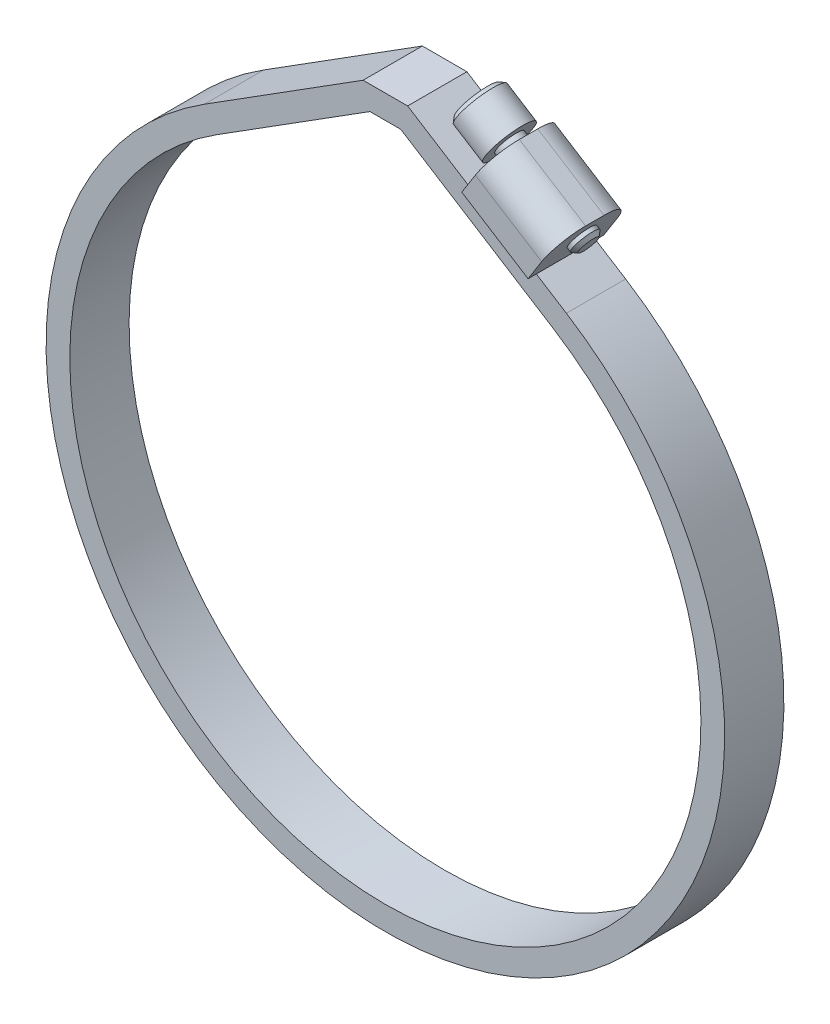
ISO-10303-21;
HEADER;
FILE_DESCRIPTION(('STEP AP214'),'2;1');
FILE_NAME('part.step','',(''),(''),'','','');
FILE_SCHEMA(('AUTOMOTIVE_DESIGN { 1 0 10303 214 1 1 1 1 }'));
ENDSEC;
DATA;
#1=APPLICATION_CONTEXT('core data for automotive mechanical design processes');
#2=APPLICATION_PROTOCOL_DEFINITION('international standard','automotive_design',2000,#1);
#3=PRODUCT_CONTEXT('',#1,'mechanical');
#4=PRODUCT('Part','Part','',(#3));
#5=PRODUCT_RELATED_PRODUCT_CATEGORY('part','',(#4));
#6=PRODUCT_DEFINITION_FORMATION('','',#4);
#7=PRODUCT_DEFINITION_CONTEXT('part definition',#1,'design');
#8=PRODUCT_DEFINITION('design','',#6,#7);
#9=PRODUCT_DEFINITION_SHAPE('','',#8);
#10=(LENGTH_UNIT() NAMED_UNIT(*) SI_UNIT(.MILLI.,.METRE.));
#11=(NAMED_UNIT(*) PLANE_ANGLE_UNIT() SI_UNIT($,.RADIAN.));
#12=(NAMED_UNIT(*) SI_UNIT($,.STERADIAN.) SOLID_ANGLE_UNIT());
#13=UNCERTAINTY_MEASURE_WITH_UNIT(LENGTH_MEASURE(1.E-05),#10,'distance_accuracy_value','');
#14=(GEOMETRIC_REPRESENTATION_CONTEXT(3) GLOBAL_UNCERTAINTY_ASSIGNED_CONTEXT((#13)) GLOBAL_UNIT_ASSIGNED_CONTEXT((#10,
#11,#12)) REPRESENTATION_CONTEXT('',''));
#15=CARTESIAN_POINT('',(0.,0.,0.));
#16=DIRECTION('',(0.,0.,1.));
#17=DIRECTION('',(1.,0.,0.));
#18=AXIS2_PLACEMENT_3D('',#15,#16,#17);
#19=CARTESIAN_POINT('',(23.8835334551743,46.7084663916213,5.0292));
#20=DIRECTION('',(-0.845790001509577,0.533515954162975,0.));
#21=DIRECTION('',(-0.533515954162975,-0.845790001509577,0.));
#22=AXIS2_PLACEMENT_3D('',#19,#20,#21);
#23=PLANE('',#22);
#24=DIRECTION('',(0.533515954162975,0.845790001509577,0.));
#25=VECTOR('',#24,1.);
#26=CARTESIAN_POINT('',(23.8835334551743,46.7084663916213,-5.0292));
#27=LINE('',#26,#25);
#28=CARTESIAN_POINT('',(20.04851407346,40.6287587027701,-5.0292));
#29=VERTEX_POINT('',#28);
#30=CARTESIAN_POINT('',(21.8508376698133,43.4860064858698,-5.0292));
#31=VERTEX_POINT('',#30);
#32=EDGE_CURVE('E288',#29,#31,#27,.T.);
#33=ORIENTED_EDGE('',*,*,#32,.T.);
#34=CARTESIAN_POINT('',(21.8508376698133,43.4860064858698,-1.2192));
#35=DIRECTION('',(-0.845790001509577,0.533515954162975,0.));
#36=DIRECTION('',(-0.533515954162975,-0.845790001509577,0.));
#37=AXIS2_PLACEMENT_3D('',#34,#35,#36);
#38=CIRCLE('',#37,3.81);
#39=CARTESIAN_POINT('',(23.8835334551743,46.7084663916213,-1.2192));
#40=VERTEX_POINT('',#39);
#41=EDGE_CURVE('E319',#31,#40,#38,.F.);
#42=ORIENTED_EDGE('',*,*,#41,.T.);
#43=DIRECTION('',(0.,0.,-1.));
#44=VECTOR('',#43,1.);
#45=CARTESIAN_POINT('',(23.8835334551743,46.7084663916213,5.0292));
#46=LINE('',#45,#44);
#47=CARTESIAN_POINT('',(23.8835334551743,46.7084663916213,1.2192));
#48=VERTEX_POINT('',#47);
#49=EDGE_CURVE('E298',#48,#40,#46,.T.);
#50=ORIENTED_EDGE('',*,*,#49,.F.);
#51=CARTESIAN_POINT('',(21.8508376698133,43.4860064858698,1.2192));
#52=DIRECTION('',(-0.845790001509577,0.533515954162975,0.));
#53=DIRECTION('',(-0.533515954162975,-0.845790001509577,0.));
#54=AXIS2_PLACEMENT_3D('',#51,#52,#53);
#55=CIRCLE('',#54,3.81);
#56=CARTESIAN_POINT('',(21.8508376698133,43.4860064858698,5.0292));
#57=VERTEX_POINT('',#56);
#58=EDGE_CURVE('E317',#48,#57,#55,.F.);
#59=ORIENTED_EDGE('',*,*,#58,.T.);
#60=DIRECTION('',(0.533515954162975,0.845790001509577,0.));
#61=VECTOR('',#60,1.);
#62=CARTESIAN_POINT('',(23.8835334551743,46.7084663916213,5.0292));
#63=LINE('',#62,#61);
#64=CARTESIAN_POINT('',(20.04851407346,40.6287587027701,5.0292));
#65=VERTEX_POINT('',#64);
#66=EDGE_CURVE('E279',#65,#57,#63,.T.);
#67=ORIENTED_EDGE('',*,*,#66,.F.);
#68=DIRECTION('',(0.,0.,-1.));
#69=VECTOR('',#68,1.);
#70=CARTESIAN_POINT('',(20.04851407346,40.6287587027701,5.0292));
#71=LINE('',#70,#69);
#72=CARTESIAN_POINT('',(20.04851407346,40.6287587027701,3.937));
#73=VERTEX_POINT('',#72);
#74=EDGE_CURVE('E302',#65,#73,#71,.T.);
#75=ORIENTED_EDGE('',*,*,#74,.T.);
#76=CARTESIAN_POINT('',(20.04851407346,40.6287587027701,-3.937));
#77=VERTEX_POINT('',#76);
#78=EDGE_CURVE('E306',#73,#77,#71,.T.);
#79=ORIENTED_EDGE('',*,*,#78,.T.);
#80=EDGE_CURVE('E301',#77,#29,#71,.T.);
#81=ORIENTED_EDGE('',*,*,#80,.T.);
#82=EDGE_LOOP('',(#33,#42,#50,#59,#67,#75,#79,#81));
#83=FACE_BOUND('',#82,.T.);
#84=CARTESIAN_POINT('',(22.1896203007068,44.0230831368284,0.));
#85=DIRECTION('',(-0.845790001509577,0.533515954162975,0.));
#86=DIRECTION('',(-0.533515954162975,-0.845790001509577,0.));
#87=AXIS2_PLACEMENT_3D('',#84,#85,#86);
#88=CIRCLE('',#87,1.74624999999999);
#89=CARTESIAN_POINT('',(21.2579680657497,42.5461223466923,0.));
#90=VERTEX_POINT('',#89);
#91=EDGE_CURVE('E11',#90,#90,#88,.F.);
#92=ORIENTED_EDGE('',*,*,#91,.F.);
#93=EDGE_LOOP('',(#92));
#94=FACE_BOUND('',#93,.T.);
#95=ADVANCED_FACE('F39',(#83,#94),#23,.F.);
#96=CARTESIAN_POINT('',(11.2456163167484,46.1815394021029,5.0292));
#97=DIRECTION('',(0.845790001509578,-0.533515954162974,0.));
#98=DIRECTION('',(0.533515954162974,0.845790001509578,0.));
#99=AXIS2_PLACEMENT_3D('',#96,#97,#98);
#100=PLANE('',#99);
#101=DIRECTION('',(0.,0.,-1.));
#102=VECTOR('',#101,1.);
#103=CARTESIAN_POINT('',(15.0806356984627,52.2612470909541,5.0292));
#104=LINE('',#103,#102);
#105=CARTESIAN_POINT('',(15.0806356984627,52.2612470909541,1.2192));
#106=VERTEX_POINT('',#105);
#107=CARTESIAN_POINT('',(15.0806356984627,52.2612470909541,-1.2192));
#108=VERTEX_POINT('',#107);
#109=EDGE_CURVE('E294',#106,#108,#104,.T.);
#110=ORIENTED_EDGE('',*,*,#109,.T.);
#111=CARTESIAN_POINT('',(13.0479399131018,49.0387871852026,-1.2192));
#112=DIRECTION('',(0.845790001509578,-0.533515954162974,0.));
#113=DIRECTION('',(0.533515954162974,0.845790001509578,0.));
#114=AXIS2_PLACEMENT_3D('',#111,#112,#113);
#115=CIRCLE('',#114,3.81);
#116=CARTESIAN_POINT('',(13.0479399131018,49.0387871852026,-5.0292));
#117=VERTEX_POINT('',#116);
#118=EDGE_CURVE('E313',#108,#117,#115,.F.);
#119=ORIENTED_EDGE('',*,*,#118,.T.);
#120=DIRECTION('',(-0.533515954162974,-0.845790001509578,0.));
#121=VECTOR('',#120,1.);
#122=CARTESIAN_POINT('',(11.2456163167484,46.1815394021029,-5.0292));
#123=LINE('',#122,#121);
#124=CARTESIAN_POINT('',(11.2456163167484,46.1815394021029,-5.0292));
#125=VERTEX_POINT('',#124);
#126=EDGE_CURVE('E280',#117,#125,#123,.T.);
#127=ORIENTED_EDGE('',*,*,#126,.T.);
#128=DIRECTION('',(0.,0.,-1.));
#129=VECTOR('',#128,1.);
#130=CARTESIAN_POINT('',(11.2456163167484,46.1815394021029,5.0292));
#131=LINE('',#130,#129);
#132=CARTESIAN_POINT('',(11.2456163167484,46.1815394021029,-3.937));
#133=VERTEX_POINT('',#132);
#134=EDGE_CURVE('E285',#133,#125,#131,.T.);
#135=ORIENTED_EDGE('',*,*,#134,.F.);
#136=CARTESIAN_POINT('',(11.2456163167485,46.1815394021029,3.937));
#137=VERTEX_POINT('',#136);
#138=EDGE_CURVE('E295',#137,#133,#131,.T.);
#139=ORIENTED_EDGE('',*,*,#138,.F.);
#140=CARTESIAN_POINT('',(11.2456163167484,46.1815394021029,5.0292));
#141=VERTEX_POINT('',#140);
#142=EDGE_CURVE('E55',#141,#137,#131,.T.);
#143=ORIENTED_EDGE('',*,*,#142,.F.);
#144=DIRECTION('',(-0.533515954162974,-0.845790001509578,0.));
#145=VECTOR('',#144,1.);
#146=CARTESIAN_POINT('',(11.2456163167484,46.1815394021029,5.0292));
#147=LINE('',#146,#145);
#148=CARTESIAN_POINT('',(13.0479399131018,49.0387871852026,5.0292));
#149=VERTEX_POINT('',#148);
#150=EDGE_CURVE('E283',#149,#141,#147,.T.);
#151=ORIENTED_EDGE('',*,*,#150,.F.);
#152=CARTESIAN_POINT('',(13.0479399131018,49.0387871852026,1.2192));
#153=DIRECTION('',(0.845790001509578,-0.533515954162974,0.));
#154=DIRECTION('',(0.533515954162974,0.845790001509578,0.));
#155=AXIS2_PLACEMENT_3D('',#152,#153,#154);
#156=CIRCLE('',#155,3.81);
#157=EDGE_CURVE('E311',#149,#106,#156,.F.);
#158=ORIENTED_EDGE('',*,*,#157,.T.);
#159=EDGE_LOOP('',(#110,#119,#127,#135,#139,#143,#151,#158));
#160=FACE_BOUND('',#159,.T.);
#161=CARTESIAN_POINT('',(13.3867225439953,49.5758638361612,0.));
#162=DIRECTION('',(0.845790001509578,-0.533515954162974,0.));
#163=DIRECTION('',(0.533515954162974,0.845790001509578,0.));
#164=AXIS2_PLACEMENT_3D('',#161,#162,#163);
#165=CIRCLE('',#164,1.74624999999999);
#166=CARTESIAN_POINT('',(14.3183747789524,51.0528246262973,0.));
#167=VERTEX_POINT('',#166);
#168=EDGE_CURVE('E43',#167,#167,#165,.F.);
#169=ORIENTED_EDGE('',*,*,#168,.F.);
#170=EDGE_LOOP('',(#169));
#171=FACE_BOUND('',#170,.T.);
#172=ADVANCED_FACE('F411',(#160,#171),#100,.F.);
#173=CARTESIAN_POINT('',(2.95750169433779,51.4096,-3.937));
#174=DIRECTION('',(0.533515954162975,0.845790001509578,0.));
#175=DIRECTION('',(-0.845790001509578,0.533515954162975,0.));
#176=AXIS2_PLACEMENT_3D('',#173,#174,#175);
#177=PLANE('',#176);
#178=DIRECTION('',(-0.845790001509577,0.533515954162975,0.));
#179=VECTOR('',#178,1.);
#180=CARTESIAN_POINT('',(2.95750169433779,51.4096,-3.937));
#181=LINE('',#180,#179);
#182=CARTESIAN_POINT('',(24.040015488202,38.1109591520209,-3.937));
#183=VERTEX_POINT('',#182);
#184=EDGE_CURVE('E363',#183,#77,#181,.T.);
#185=ORIENTED_EDGE('',*,*,#184,.T.);
#186=ORIENTED_EDGE('',*,*,#78,.F.);
#187=DIRECTION('',(-0.845790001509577,0.533515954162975,0.));
#188=VECTOR('',#187,1.);
#189=CARTESIAN_POINT('',(2.95750169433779,51.4096,3.937));
#190=LINE('',#189,#188);
#191=CARTESIAN_POINT('',(24.040015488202,38.1109591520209,3.937));
#192=VERTEX_POINT('',#191);
#193=EDGE_CURVE('E373',#192,#73,#190,.T.);
#194=ORIENTED_EDGE('',*,*,#193,.F.);
#195=DIRECTION('',(0.,0.,1.));
#196=VECTOR('',#195,1.);
#197=CARTESIAN_POINT('',(24.040015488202,38.1109591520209,-3.937));
#198=LINE('',#197,#196);
#199=EDGE_CURVE('E90',#183,#192,#198,.T.);
#200=ORIENTED_EDGE('',*,*,#199,.F.);
#201=EDGE_LOOP('',(#185,#186,#194,#200));
#202=FACE_BOUND('',#201,.T.);
#203=ADVANCED_FACE('F388',(#202),#177,.T.);
#204=CARTESIAN_POINT('',(2.95750169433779,51.4096,3.937));
#205=VERTEX_POINT('',#204);
#206=EDGE_CURVE('E372',#137,#205,#190,.T.);
#207=ORIENTED_EDGE('',*,*,#206,.F.);
#208=ORIENTED_EDGE('',*,*,#138,.T.);
#209=CARTESIAN_POINT('',(2.95750169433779,51.4096,-3.937));
#210=VERTEX_POINT('',#209);
#211=EDGE_CURVE('E361',#133,#210,#181,.T.);
#212=ORIENTED_EDGE('',*,*,#211,.T.);
#213=DIRECTION('',(0.,0.,1.));
#214=VECTOR('',#213,1.);
#215=CARTESIAN_POINT('',(2.95750169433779,51.4096,-3.937));
#216=LINE('',#215,#214);
#217=EDGE_CURVE('E385',#210,#205,#216,.T.);
#218=ORIENTED_EDGE('',*,*,#217,.T.);
#219=EDGE_LOOP('',(#207,#208,#212,#218));
#220=FACE_BOUND('',#219,.T.);
#221=ADVANCED_FACE('F417',(#220),#177,.T.);
#222=CARTESIAN_POINT('',(0.,0.,-3.937));
#223=DIRECTION('',(0.,0.,1.));
#224=DIRECTION('',(1.,0.,0.));
#225=AXIS2_PLACEMENT_3D('',#222,#223,#224);
#226=CYLINDRICAL_SURFACE('',#225,45.0596);
#227=CARTESIAN_POINT('',(0.,0.,3.937));
#228=DIRECTION('',(0.,0.,1.));
#229=DIRECTION('',(1.,0.,0.));
#230=AXIS2_PLACEMENT_3D('',#227,#228,#229);
#231=CIRCLE('',#230,45.0596);
#232=CARTESIAN_POINT('',(-24.040015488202,38.1109591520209,3.937));
#233=VERTEX_POINT('',#232);
#234=EDGE_CURVE('E330',#233,#192,#231,.T.);
#235=ORIENTED_EDGE('',*,*,#234,.F.);
#236=DIRECTION('',(0.,0.,1.));
#237=VECTOR('',#236,1.);
#238=CARTESIAN_POINT('',(-24.040015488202,38.1109591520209,-3.937));
#239=LINE('',#238,#237);
#240=CARTESIAN_POINT('',(-24.040015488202,38.1109591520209,-3.937));
#241=VERTEX_POINT('',#240);
#242=EDGE_CURVE('E64',#241,#233,#239,.T.);
#243=ORIENTED_EDGE('',*,*,#242,.F.);
#244=CARTESIAN_POINT('',(0.,0.,-3.937));
#245=DIRECTION('',(0.,0.,1.));
#246=DIRECTION('',(1.,0.,0.));
#247=AXIS2_PLACEMENT_3D('',#244,#245,#246);
#248=CIRCLE('',#247,45.0596);
#249=EDGE_CURVE('E359',#241,#183,#248,.T.);
#250=ORIENTED_EDGE('',*,*,#249,.T.);
#251=ORIENTED_EDGE('',*,*,#199,.T.);
#252=EDGE_LOOP('',(#235,#243,#250,#251));
#253=FACE_BOUND('',#252,.T.);
#254=ADVANCED_FACE('F41',(#253),#226,.T.);
#255=CARTESIAN_POINT('',(-24.040015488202,38.1109591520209,-3.937));
#256=DIRECTION('',(-0.533515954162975,0.845790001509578,0.));
#257=DIRECTION('',(-0.845790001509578,-0.533515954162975,0.));
#258=AXIS2_PLACEMENT_3D('',#255,#256,#257);
#259=PLANE('',#258);
#260=DIRECTION('',(-0.845790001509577,-0.533515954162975,0.));
#261=VECTOR('',#260,1.);
#262=CARTESIAN_POINT('',(-24.040015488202,38.1109591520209,3.937));
#263=LINE('',#262,#261);
#264=CARTESIAN_POINT('',(-2.95750169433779,51.4096,3.937));
#265=VERTEX_POINT('',#264);
#266=EDGE_CURVE('E362',#265,#233,#263,.T.);
#267=ORIENTED_EDGE('',*,*,#266,.F.);
#268=DIRECTION('',(0.,0.,1.));
#269=VECTOR('',#268,1.);
#270=CARTESIAN_POINT('',(-2.95750169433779,51.4096,-3.937));
#271=LINE('',#270,#269);
#272=CARTESIAN_POINT('',(-2.95750169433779,51.4096,-3.937));
#273=VERTEX_POINT('',#272);
#274=EDGE_CURVE('E383',#273,#265,#271,.T.);
#275=ORIENTED_EDGE('',*,*,#274,.F.);
#276=DIRECTION('',(-0.845790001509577,-0.533515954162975,0.));
#277=VECTOR('',#276,1.);
#278=CARTESIAN_POINT('',(-24.040015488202,38.1109591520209,-3.937));
#279=LINE('',#278,#277);
#280=EDGE_CURVE('E368',#273,#241,#279,.T.);
#281=ORIENTED_EDGE('',*,*,#280,.T.);
#282=ORIENTED_EDGE('',*,*,#242,.T.);
#283=EDGE_LOOP('',(#267,#275,#281,#282));
#284=FACE_BOUND('',#283,.T.);
#285=ADVANCED_FACE('F395',(#284),#259,.T.);
#286=CARTESIAN_POINT('',(-2.95750169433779,51.4096,-3.937));
#287=DIRECTION('',(0.,1.,0.));
#288=DIRECTION('',(0.,0.,1.));
#289=AXIS2_PLACEMENT_3D('',#286,#287,#288);
#290=PLANE('',#289);
#291=DIRECTION('',(-1.,0.,0.));
#292=VECTOR('',#291,1.);
#293=CARTESIAN_POINT('',(-2.95750169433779,51.4096,3.937));
#294=LINE('',#293,#292);
#295=EDGE_CURVE('E376',#205,#265,#294,.T.);
#296=ORIENTED_EDGE('',*,*,#295,.F.);
#297=ORIENTED_EDGE('',*,*,#217,.F.);
#298=DIRECTION('',(-1.,0.,0.));
#299=VECTOR('',#298,1.);
#300=CARTESIAN_POINT('',(-2.95750169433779,51.4096,-3.937));
#301=LINE('',#300,#299);
#302=EDGE_CURVE('E365',#210,#273,#301,.T.);
#303=ORIENTED_EDGE('',*,*,#302,.T.);
#304=ORIENTED_EDGE('',*,*,#274,.T.);
#305=EDGE_LOOP('',(#296,#297,#303,#304));
#306=FACE_BOUND('',#305,.T.);
#307=ADVANCED_FACE('F400',(#306),#290,.T.);
#308=CARTESIAN_POINT('',(0.,0.,-3.937));
#309=DIRECTION('',(0.,0.,1.));
#310=DIRECTION('',(1.,0.,0.));
#311=AXIS2_PLACEMENT_3D('',#308,#309,#310);
#312=PLANE('',#311);
#313=ORIENTED_EDGE('',*,*,#249,.F.);
#314=ORIENTED_EDGE('',*,*,#280,.F.);
#315=ORIENTED_EDGE('',*,*,#302,.F.);
#316=ORIENTED_EDGE('',*,*,#211,.F.);
#317=DIRECTION('',(-0.845790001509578,0.533515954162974,0.));
#318=VECTOR('',#317,1.);
#319=CARTESIAN_POINT('',(24.040015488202,38.110959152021,-3.937));
#320=LINE('',#319,#318);
#321=EDGE_CURVE('E324',#77,#133,#320,.T.);
#322=ORIENTED_EDGE('',*,*,#321,.F.);
#323=ORIENTED_EDGE('',*,*,#184,.F.);
#324=EDGE_LOOP('',(#313,#314,#315,#316,#322,#323));
#325=FACE_BOUND('',#324,.T.);
#326=DIRECTION('',(0.845790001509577,0.533515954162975,0.));
#327=VECTOR('',#326,1.);
#328=CARTESIAN_POINT('',(-2.04712627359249,48.26,-3.937));
#329=LINE('',#328,#327);
#330=CARTESIAN_POINT('',(-22.3596536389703,35.4470589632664,-3.937));
#331=VERTEX_POINT('',#330);
#332=CARTESIAN_POINT('',(-2.04712627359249,48.26,-3.937));
#333=VERTEX_POINT('',#332);
#334=EDGE_CURVE('E337',#331,#333,#329,.T.);
#335=ORIENTED_EDGE('',*,*,#334,.F.);
#336=CARTESIAN_POINT('',(0.,0.,-3.937));
#337=DIRECTION('',(0.,0.,1.));
#338=DIRECTION('',(1.,0.,0.));
#339=AXIS2_PLACEMENT_3D('',#336,#337,#338);
#340=CIRCLE('',#339,41.91);
#341=CARTESIAN_POINT('',(22.3596536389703,35.4470589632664,-3.937));
#342=VERTEX_POINT('',#341);
#343=EDGE_CURVE('E327',#342,#331,#340,.F.);
#344=ORIENTED_EDGE('',*,*,#343,.F.);
#345=DIRECTION('',(0.845790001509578,-0.533515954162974,0.));
#346=VECTOR('',#345,1.);
#347=CARTESIAN_POINT('',(22.3596536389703,35.4470589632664,-3.937));
#348=LINE('',#347,#346);
#349=CARTESIAN_POINT('',(2.0471262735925,48.26,-3.937));
#350=VERTEX_POINT('',#349);
#351=EDGE_CURVE('E331',#350,#342,#348,.T.);
#352=ORIENTED_EDGE('',*,*,#351,.F.);
#353=DIRECTION('',(1.,0.,0.));
#354=VECTOR('',#353,1.);
#355=CARTESIAN_POINT('',(2.0471262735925,48.26,-3.937));
#356=LINE('',#355,#354);
#357=EDGE_CURVE('E334',#333,#350,#356,.T.);
#358=ORIENTED_EDGE('',*,*,#357,.F.);
#359=EDGE_LOOP('',(#335,#344,#352,#358));
#360=FACE_BOUND('',#359,.T.);
#361=ADVANCED_FACE('F403',(#325,#360),#312,.F.);
#362=CARTESIAN_POINT('',(0.,0.,3.937));
#363=DIRECTION('',(0.,0.,1.));
#364=DIRECTION('',(1.,0.,0.));
#365=AXIS2_PLACEMENT_3D('',#362,#363,#364);
#366=PLANE('',#365);
#367=ORIENTED_EDGE('',*,*,#234,.T.);
#368=ORIENTED_EDGE('',*,*,#193,.T.);
#369=EDGE_CURVE('E377',#73,#137,#190,.T.);
#370=ORIENTED_EDGE('',*,*,#369,.T.);
#371=ORIENTED_EDGE('',*,*,#206,.T.);
#372=ORIENTED_EDGE('',*,*,#295,.T.);
#373=ORIENTED_EDGE('',*,*,#266,.T.);
#374=EDGE_LOOP('',(#367,#368,#370,#371,#372,#373));
#375=FACE_BOUND('',#374,.T.);
#376=DIRECTION('',(-1.,0.,0.));
#377=VECTOR('',#376,1.);
#378=CARTESIAN_POINT('',(2.0471262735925,48.26,3.937));
#379=LINE('',#378,#377);
#380=CARTESIAN_POINT('',(2.0471262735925,48.26,3.937));
#381=VERTEX_POINT('',#380);
#382=CARTESIAN_POINT('',(-2.04712627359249,48.26,3.937));
#383=VERTEX_POINT('',#382);
#384=EDGE_CURVE('E326',#381,#383,#379,.T.);
#385=ORIENTED_EDGE('',*,*,#384,.F.);
#386=DIRECTION('',(-0.845790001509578,0.533515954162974,0.));
#387=VECTOR('',#386,1.);
#388=CARTESIAN_POINT('',(22.3596536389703,35.4470589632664,3.937));
#389=LINE('',#388,#387);
#390=CARTESIAN_POINT('',(22.3596536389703,35.4470589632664,3.937));
#391=VERTEX_POINT('',#390);
#392=EDGE_CURVE('E346',#391,#381,#389,.T.);
#393=ORIENTED_EDGE('',*,*,#392,.F.);
#394=CARTESIAN_POINT('',(0.,0.,3.937));
#395=DIRECTION('',(0.,0.,1.));
#396=DIRECTION('',(1.,0.,0.));
#397=AXIS2_PLACEMENT_3D('',#394,#395,#396);
#398=CIRCLE('',#397,41.91);
#399=CARTESIAN_POINT('',(-22.3596536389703,35.4470589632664,3.937));
#400=VERTEX_POINT('',#399);
#401=EDGE_CURVE('E343',#400,#391,#398,.T.);
#402=ORIENTED_EDGE('',*,*,#401,.F.);
#403=DIRECTION('',(-0.845790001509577,-0.533515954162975,0.));
#404=VECTOR('',#403,1.);
#405=CARTESIAN_POINT('',(-2.04712627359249,48.26,3.937));
#406=LINE('',#405,#404);
#407=EDGE_CURVE('E340',#383,#400,#406,.T.);
#408=ORIENTED_EDGE('',*,*,#407,.F.);
#409=EDGE_LOOP('',(#385,#393,#402,#408));
#410=FACE_BOUND('',#409,.T.);
#411=ADVANCED_FACE('F392',(#375,#410),#366,.T.);
#412=CARTESIAN_POINT('',(-2.04712627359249,48.26,-134.228106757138));
#413=DIRECTION('',(-0.533515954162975,0.845790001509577,0.));
#414=DIRECTION('',(-0.845790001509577,-0.533515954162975,0.));
#415=AXIS2_PLACEMENT_3D('',#412,#413,#414);
#416=PLANE('',#415);
#417=DIRECTION('',(0.,0.,1.));
#418=VECTOR('',#417,1.);
#419=CARTESIAN_POINT('',(-22.3596536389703,35.4470589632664,-134.228106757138));
#420=LINE('',#419,#418);
#421=EDGE_CURVE('E354',#331,#400,#420,.T.);
#422=ORIENTED_EDGE('',*,*,#421,.F.);
#423=ORIENTED_EDGE('',*,*,#334,.T.);
#424=DIRECTION('',(0.,0.,1.));
#425=VECTOR('',#424,1.);
#426=CARTESIAN_POINT('',(-2.04712627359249,48.26,-134.228106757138));
#427=LINE('',#426,#425);
#428=EDGE_CURVE('E349',#333,#383,#427,.T.);
#429=ORIENTED_EDGE('',*,*,#428,.T.);
#430=ORIENTED_EDGE('',*,*,#407,.T.);
#431=EDGE_LOOP('',(#422,#423,#429,#430));
#432=FACE_BOUND('',#431,.T.);
#433=ADVANCED_FACE('F475',(#432),#416,.F.);
#434=CARTESIAN_POINT('',(0.,0.,-134.228106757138));
#435=DIRECTION('',(0.,0.,1.));
#436=DIRECTION('',(1.,0.,0.));
#437=AXIS2_PLACEMENT_3D('',#434,#435,#436);
#438=CYLINDRICAL_SURFACE('',#437,41.91);
#439=DIRECTION('',(0.,0.,1.));
#440=VECTOR('',#439,1.);
#441=CARTESIAN_POINT('',(22.3596536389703,35.4470589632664,-134.228106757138));
#442=LINE('',#441,#440);
#443=EDGE_CURVE('E352',#342,#391,#442,.T.);
#444=ORIENTED_EDGE('',*,*,#443,.F.);
#445=ORIENTED_EDGE('',*,*,#343,.T.);
#446=ORIENTED_EDGE('',*,*,#421,.T.);
#447=ORIENTED_EDGE('',*,*,#401,.T.);
#448=EDGE_LOOP('',(#444,#445,#446,#447));
#449=FACE_BOUND('',#448,.T.);
#450=ADVANCED_FACE('F470',(#449),#438,.F.);
#451=CARTESIAN_POINT('',(22.3596536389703,35.4470589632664,-134.228106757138));
#452=DIRECTION('',(0.533515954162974,0.845790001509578,0.));
#453=DIRECTION('',(-0.845790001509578,0.533515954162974,0.));
#454=AXIS2_PLACEMENT_3D('',#451,#452,#453);
#455=PLANE('',#454);
#456=DIRECTION('',(0.,0.,1.));
#457=VECTOR('',#456,1.);
#458=CARTESIAN_POINT('',(2.0471262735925,48.26,-134.228106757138));
#459=LINE('',#458,#457);
#460=EDGE_CURVE('E350',#350,#381,#459,.T.);
#461=ORIENTED_EDGE('',*,*,#460,.F.);
#462=ORIENTED_EDGE('',*,*,#351,.T.);
#463=ORIENTED_EDGE('',*,*,#443,.T.);
#464=ORIENTED_EDGE('',*,*,#392,.T.);
#465=EDGE_LOOP('',(#461,#462,#463,#464));
#466=FACE_BOUND('',#465,.T.);
#467=ADVANCED_FACE('F464',(#466),#455,.F.);
#468=CARTESIAN_POINT('',(2.0471262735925,48.26,-134.228106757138));
#469=DIRECTION('',(0.,1.,0.));
#470=DIRECTION('',(0.,0.,1.));
#471=AXIS2_PLACEMENT_3D('',#468,#469,#470);
#472=PLANE('',#471);
#473=ORIENTED_EDGE('',*,*,#428,.F.);
#474=ORIENTED_EDGE('',*,*,#357,.T.);
#475=ORIENTED_EDGE('',*,*,#460,.T.);
#476=ORIENTED_EDGE('',*,*,#384,.T.);
#477=EDGE_LOOP('',(#473,#474,#475,#476));
#478=FACE_BOUND('',#477,.T.);
#479=ADVANCED_FACE('F460',(#478),#472,.F.);
#480=CARTESIAN_POINT('',(11.2456163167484,46.1815394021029,5.0292));
#481=DIRECTION('',(0.533515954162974,0.845790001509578,0.));
#482=DIRECTION('',(-0.845790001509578,0.533515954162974,0.));
#483=AXIS2_PLACEMENT_3D('',#480,#481,#482);
#484=PLANE('',#483);
#485=ORIENTED_EDGE('',*,*,#80,.F.);
#486=ORIENTED_EDGE('',*,*,#321,.T.);
#487=ORIENTED_EDGE('',*,*,#134,.T.);
#488=DIRECTION('',(0.845790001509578,-0.533515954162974,0.));
#489=VECTOR('',#488,1.);
#490=CARTESIAN_POINT('',(11.2456163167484,46.1815394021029,-5.0292));
#491=LINE('',#490,#489);
#492=EDGE_CURVE('E274',#125,#29,#491,.T.);
#493=ORIENTED_EDGE('',*,*,#492,.T.);
#494=EDGE_LOOP('',(#485,#486,#487,#493));
#495=FACE_BOUND('',#494,.T.);
#496=ADVANCED_FACE('F408',(#495),#484,.F.);
#497=ORIENTED_EDGE('',*,*,#369,.F.);
#498=ORIENTED_EDGE('',*,*,#74,.F.);
#499=DIRECTION('',(0.845790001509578,-0.533515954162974,0.));
#500=VECTOR('',#499,1.);
#501=CARTESIAN_POINT('',(11.2456163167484,46.1815394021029,5.0292));
#502=LINE('',#501,#500);
#503=EDGE_CURVE('E276',#141,#65,#502,.T.);
#504=ORIENTED_EDGE('',*,*,#503,.F.);
#505=ORIENTED_EDGE('',*,*,#142,.T.);
#506=EDGE_LOOP('',(#497,#498,#504,#505));
#507=FACE_BOUND('',#506,.T.);
#508=ADVANCED_FACE('F419',(#507),#484,.F.);
#509=CARTESIAN_POINT('',(15.0806356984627,52.2612470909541,5.0292));
#510=DIRECTION('',(-0.533515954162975,-0.845790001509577,0.));
#511=DIRECTION('',(0.845790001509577,-0.533515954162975,0.));
#512=AXIS2_PLACEMENT_3D('',#509,#510,#511);
#513=PLANE('',#512);
#514=ORIENTED_EDGE('',*,*,#49,.T.);
#515=DIRECTION('',(-0.845790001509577,0.533515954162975,0.));
#516=VECTOR('',#515,1.);
#517=CARTESIAN_POINT('',(15.0806356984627,52.2612470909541,-1.2192));
#518=LINE('',#517,#516);
#519=EDGE_CURVE('E308',#40,#108,#518,.T.);
#520=ORIENTED_EDGE('',*,*,#519,.T.);
#521=ORIENTED_EDGE('',*,*,#109,.F.);
#522=DIRECTION('',(-0.845790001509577,0.533515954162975,0.));
#523=VECTOR('',#522,1.);
#524=CARTESIAN_POINT('',(23.8835334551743,46.7084663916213,1.2192));
#525=LINE('',#524,#523);
#526=EDGE_CURVE('E305',#106,#48,#525,.F.);
#527=ORIENTED_EDGE('',*,*,#526,.T.);
#528=EDGE_LOOP('',(#514,#520,#521,#527));
#529=FACE_BOUND('',#528,.T.);
#530=ADVANCED_FACE('F432',(#529),#513,.F.);
#531=CARTESIAN_POINT('',(11.2456163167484,46.1815394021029,5.0292));
#532=DIRECTION('',(0.,0.,1.));
#533=DIRECTION('',(1.,0.,0.));
#534=AXIS2_PLACEMENT_3D('',#531,#532,#533);
#535=PLANE('',#534);
#536=ORIENTED_EDGE('',*,*,#66,.T.);
#537=DIRECTION('',(-0.845790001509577,0.533515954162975,0.));
#538=VECTOR('',#537,1.);
#539=CARTESIAN_POINT('',(13.0479399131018,49.0387871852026,5.0292));
#540=LINE('',#539,#538);
#541=EDGE_CURVE('E321',#57,#149,#540,.T.);
#542=ORIENTED_EDGE('',*,*,#541,.T.);
#543=ORIENTED_EDGE('',*,*,#150,.T.);
#544=ORIENTED_EDGE('',*,*,#503,.T.);
#545=EDGE_LOOP('',(#536,#542,#543,#544));
#546=FACE_BOUND('',#545,.T.);
#547=ADVANCED_FACE('F426',(#546),#535,.T.);
#548=CARTESIAN_POINT('',(11.2456163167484,46.1815394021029,-5.0292));
#549=DIRECTION('',(0.,0.,1.));
#550=DIRECTION('',(1.,0.,0.));
#551=AXIS2_PLACEMENT_3D('',#548,#549,#550);
#552=PLANE('',#551);
#553=ORIENTED_EDGE('',*,*,#126,.F.);
#554=DIRECTION('',(-0.845790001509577,0.533515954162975,0.));
#555=VECTOR('',#554,1.);
#556=CARTESIAN_POINT('',(13.0479399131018,49.0387871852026,-5.0292));
#557=LINE('',#556,#555);
#558=EDGE_CURVE('E315',#117,#31,#557,.F.);
#559=ORIENTED_EDGE('',*,*,#558,.T.);
#560=ORIENTED_EDGE('',*,*,#32,.F.);
#561=ORIENTED_EDGE('',*,*,#492,.F.);
#562=EDGE_LOOP('',(#553,#559,#560,#561));
#563=FACE_BOUND('',#562,.T.);
#564=ADVANCED_FACE('F443',(#563),#552,.F.);
#565=CARTESIAN_POINT('',(13.0479399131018,49.0387871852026,-1.2192));
#566=DIRECTION('',(-0.845790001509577,0.533515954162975,0.));
#567=DIRECTION('',(-0.533515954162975,-0.845790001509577,0.));
#568=AXIS2_PLACEMENT_3D('',#565,#566,#567);
#569=CYLINDRICAL_SURFACE('',#568,3.81);
#570=ORIENTED_EDGE('',*,*,#41,.F.);
#571=ORIENTED_EDGE('',*,*,#558,.F.);
#572=ORIENTED_EDGE('',*,*,#118,.F.);
#573=ORIENTED_EDGE('',*,*,#519,.F.);
#574=EDGE_LOOP('',(#570,#571,#572,#573));
#575=FACE_BOUND('',#574,.T.);
#576=ADVANCED_FACE('F436',(#575),#569,.T.);
#577=CARTESIAN_POINT('',(13.0479399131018,49.0387871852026,1.2192));
#578=DIRECTION('',(0.845790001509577,-0.533515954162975,0.));
#579=DIRECTION('',(0.533515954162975,0.845790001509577,0.));
#580=AXIS2_PLACEMENT_3D('',#577,#578,#579);
#581=CYLINDRICAL_SURFACE('',#580,3.81);
#582=ORIENTED_EDGE('',*,*,#58,.F.);
#583=ORIENTED_EDGE('',*,*,#526,.F.);
#584=ORIENTED_EDGE('',*,*,#157,.F.);
#585=ORIENTED_EDGE('',*,*,#541,.F.);
#586=EDGE_LOOP('',(#582,#583,#584,#585));
#587=FACE_BOUND('',#586,.T.);
#588=ADVANCED_FACE('F434',(#587),#581,.T.);
#589=CARTESIAN_POINT('',(11.5908966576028,53.4391192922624,0.));
#590=DIRECTION('',(-0.845790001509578,0.533515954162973,0.));
#591=DIRECTION('',(-0.533515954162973,-0.845790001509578,0.));
#592=AXIS2_PLACEMENT_3D('',#589,#590,#591);
#593=PLANE('',#592);
#594=DIRECTION('',(0.266757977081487,0.422895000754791,-0.866025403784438));
#595=VECTOR('',#594,1.);
#596=CARTESIAN_POINT('',(10.9748454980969,52.4624851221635,2.00000000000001));
#597=LINE('',#596,#595);
#598=CARTESIAN_POINT('',(10.9748454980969,52.4624851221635,2.00000000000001));
#599=VERTEX_POINT('',#598);
#600=CARTESIAN_POINT('',(11.5908966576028,53.4391192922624,0.));
#601=VERTEX_POINT('',#600);
#602=EDGE_CURVE('E203',#599,#601,#597,.T.);
#603=ORIENTED_EDGE('',*,*,#602,.T.);
#604=DIRECTION('',(-0.266757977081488,-0.42289500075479,-0.866025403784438));
#605=VECTOR('',#604,1.);
#606=CARTESIAN_POINT('',(11.5908966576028,53.4391192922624,0.));
#607=LINE('',#606,#605);
#608=CARTESIAN_POINT('',(10.9748454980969,52.4624851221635,-2.));
#609=VERTEX_POINT('',#608);
#610=EDGE_CURVE('E214',#601,#609,#607,.T.);
#611=ORIENTED_EDGE('',*,*,#610,.T.);
#612=DIRECTION('',(-0.533515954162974,-0.845790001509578,0.));
#613=VECTOR('',#612,1.);
#614=CARTESIAN_POINT('',(10.9748454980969,52.4624851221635,-2.));
#615=LINE('',#614,#613);
#616=CARTESIAN_POINT('',(9.7427431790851,50.5092167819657,-2.));
#617=VERTEX_POINT('',#616);
#618=EDGE_CURVE('E219',#609,#617,#615,.T.);
#619=ORIENTED_EDGE('',*,*,#618,.T.);
#620=DIRECTION('',(-0.266757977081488,-0.422895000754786,0.86602540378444));
#621=VECTOR('',#620,1.);
#622=CARTESIAN_POINT('',(9.7427431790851,50.5092167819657,-2.));
#623=LINE('',#622,#621);
#624=CARTESIAN_POINT('',(9.12669201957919,49.5325826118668,0.));
#625=VERTEX_POINT('',#624);
#626=EDGE_CURVE('E231',#617,#625,#623,.T.);
#627=ORIENTED_EDGE('',*,*,#626,.T.);
#628=DIRECTION('',(0.266757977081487,0.422895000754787,0.866025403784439));
#629=VECTOR('',#628,1.);
#630=CARTESIAN_POINT('',(9.12669201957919,49.5325826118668,0.));
#631=LINE('',#630,#629);
#632=CARTESIAN_POINT('',(9.74274317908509,50.5092167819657,2.00000000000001));
#633=VERTEX_POINT('',#632);
#634=EDGE_CURVE('E234',#625,#633,#631,.T.);
#635=ORIENTED_EDGE('',*,*,#634,.T.);
#636=DIRECTION('',(0.533515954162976,0.845790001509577,0.));
#637=VECTOR('',#636,1.);
#638=CARTESIAN_POINT('',(9.74274317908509,50.5092167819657,2.00000000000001));
#639=LINE('',#638,#637);
#640=EDGE_CURVE('E211',#633,#599,#639,.T.);
#641=ORIENTED_EDGE('',*,*,#640,.T.);
#642=EDGE_LOOP('',(#603,#611,#619,#627,#635,#641));
#643=FACE_BOUND('',#642,.T.);
#644=ADVANCED_FACE('F221',(#643),#593,.T.);
#645=CARTESIAN_POINT('',(11.5908966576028,53.4391192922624,0.));
#646=DIRECTION('',(0.46203836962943,0.732475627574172,-0.500000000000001));
#647=DIRECTION('',(0.,0.56378688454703,0.825920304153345));
#648=AXIS2_PLACEMENT_3D('',#645,#646,#647);
#649=PLANE('',#648);
#650=DIRECTION('',(-0.266757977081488,-0.42289500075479,-0.866025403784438));
#651=VECTOR('',#650,1.);
#652=CARTESIAN_POINT('',(9.47642165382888,54.7729091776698,0.));
#653=LINE('',#652,#651);
#654=CARTESIAN_POINT('',(9.47642165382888,54.7729091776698,0.));
#655=VERTEX_POINT('',#654);
#656=CARTESIAN_POINT('',(8.86037049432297,53.7962750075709,-2.));
#657=VERTEX_POINT('',#656);
#658=EDGE_CURVE('E238',#655,#657,#653,.T.);
#659=ORIENTED_EDGE('',*,*,#658,.T.);
#660=DIRECTION('',(-0.845790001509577,0.533515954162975,0.));
#661=VECTOR('',#660,1.);
#662=CARTESIAN_POINT('',(10.9748454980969,52.4624851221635,-2.));
#663=LINE('',#662,#661);
#664=EDGE_CURVE('E210',#609,#657,#663,.T.);
#665=ORIENTED_EDGE('',*,*,#664,.F.);
#666=ORIENTED_EDGE('',*,*,#610,.F.);
#667=DIRECTION('',(-0.845790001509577,0.533515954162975,0.));
#668=VECTOR('',#667,1.);
#669=CARTESIAN_POINT('',(11.5908966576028,53.4391192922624,0.));
#670=LINE('',#669,#668);
#671=EDGE_CURVE('E199',#601,#655,#670,.T.);
#672=ORIENTED_EDGE('',*,*,#671,.T.);
#673=EDGE_LOOP('',(#659,#665,#666,#672));
#674=FACE_BOUND('',#673,.T.);
#675=ADVANCED_FACE('F215',(#674),#649,.F.);
#676=CARTESIAN_POINT('',(10.9748454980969,52.4624851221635,-2.));
#677=DIRECTION('',(0.,0.,-1.));
#678=DIRECTION('',(-1.,0.,0.));
#679=AXIS2_PLACEMENT_3D('',#676,#677,#678);
#680=PLANE('',#679);
#681=DIRECTION('',(-0.533515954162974,-0.845790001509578,0.));
#682=VECTOR('',#681,1.);
#683=CARTESIAN_POINT('',(8.86037049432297,53.7962750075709,-2.));
#684=LINE('',#683,#682);
#685=CARTESIAN_POINT('',(7.62826817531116,51.8430066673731,-2.));
#686=VERTEX_POINT('',#685);
#687=EDGE_CURVE('E240',#657,#686,#684,.T.);
#688=ORIENTED_EDGE('',*,*,#687,.T.);
#689=DIRECTION('',(-0.845790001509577,0.533515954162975,0.));
#690=VECTOR('',#689,1.);
#691=CARTESIAN_POINT('',(9.7427431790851,50.5092167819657,-2.));
#692=LINE('',#691,#690);
#693=EDGE_CURVE('E255',#617,#686,#692,.T.);
#694=ORIENTED_EDGE('',*,*,#693,.F.);
#695=ORIENTED_EDGE('',*,*,#618,.F.);
#696=ORIENTED_EDGE('',*,*,#664,.T.);
#697=EDGE_LOOP('',(#688,#694,#695,#696));
#698=FACE_BOUND('',#697,.T.);
#699=ADVANCED_FACE('F585',(#698),#680,.F.);
#700=CARTESIAN_POINT('',(9.7427431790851,50.5092167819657,-2.));
#701=DIRECTION('',(-0.462038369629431,-0.732475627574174,-0.499999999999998));
#702=DIRECTION('',(0.,0.563786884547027,-0.825920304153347));
#703=AXIS2_PLACEMENT_3D('',#700,#701,#702);
#704=PLANE('',#703);
#705=DIRECTION('',(-0.266757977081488,-0.422895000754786,0.86602540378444));
#706=VECTOR('',#705,1.);
#707=CARTESIAN_POINT('',(7.62826817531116,51.8430066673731,-2.));
#708=LINE('',#707,#706);
#709=CARTESIAN_POINT('',(7.01221701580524,50.8663724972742,0.));
#710=VERTEX_POINT('',#709);
#711=EDGE_CURVE('E243',#686,#710,#708,.T.);
#712=ORIENTED_EDGE('',*,*,#711,.T.);
#713=DIRECTION('',(-0.845790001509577,0.533515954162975,0.));
#714=VECTOR('',#713,1.);
#715=CARTESIAN_POINT('',(9.12669201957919,49.5325826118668,0.));
#716=LINE('',#715,#714);
#717=EDGE_CURVE('E253',#625,#710,#716,.T.);
#718=ORIENTED_EDGE('',*,*,#717,.F.);
#719=ORIENTED_EDGE('',*,*,#626,.F.);
#720=ORIENTED_EDGE('',*,*,#693,.T.);
#721=EDGE_LOOP('',(#712,#718,#719,#720));
#722=FACE_BOUND('',#721,.T.);
#723=ADVANCED_FACE('F594',(#722),#704,.F.);
#724=CARTESIAN_POINT('',(9.12669201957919,49.5325826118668,0.));
#725=DIRECTION('',(-0.462038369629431,-0.732475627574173,0.499999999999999));
#726=DIRECTION('',(0.,-0.563786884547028,-0.825920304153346));
#727=AXIS2_PLACEMENT_3D('',#724,#725,#726);
#728=PLANE('',#727);
#729=DIRECTION('',(0.266757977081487,0.422895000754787,0.866025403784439));
#730=VECTOR('',#729,1.);
#731=CARTESIAN_POINT('',(7.01221701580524,50.8663724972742,0.));
#732=LINE('',#731,#730);
#733=CARTESIAN_POINT('',(7.62826817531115,51.8430066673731,2.00000000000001));
#734=VERTEX_POINT('',#733);
#735=EDGE_CURVE('E227',#710,#734,#732,.T.);
#736=ORIENTED_EDGE('',*,*,#735,.T.);
#737=DIRECTION('',(-0.845790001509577,0.533515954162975,0.));
#738=VECTOR('',#737,1.);
#739=CARTESIAN_POINT('',(9.74274317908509,50.5092167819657,2.00000000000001));
#740=LINE('',#739,#738);
#741=EDGE_CURVE('E251',#633,#734,#740,.T.);
#742=ORIENTED_EDGE('',*,*,#741,.F.);
#743=ORIENTED_EDGE('',*,*,#634,.F.);
#744=ORIENTED_EDGE('',*,*,#717,.T.);
#745=EDGE_LOOP('',(#736,#742,#743,#744));
#746=FACE_BOUND('',#745,.T.);
#747=ADVANCED_FACE('F604',(#746),#728,.F.);
#748=CARTESIAN_POINT('',(9.74274317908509,50.5092167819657,2.00000000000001));
#749=DIRECTION('',(0.,0.,1.));
#750=DIRECTION('',(1.,0.,0.));
#751=AXIS2_PLACEMENT_3D('',#748,#749,#750);
#752=PLANE('',#751);
#753=DIRECTION('',(0.533515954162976,0.845790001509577,0.));
#754=VECTOR('',#753,1.);
#755=CARTESIAN_POINT('',(7.62826817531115,51.8430066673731,2.00000000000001));
#756=LINE('',#755,#754);
#757=CARTESIAN_POINT('',(8.86037049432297,53.7962750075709,2.00000000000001));
#758=VERTEX_POINT('',#757);
#759=EDGE_CURVE('E224',#734,#758,#756,.T.);
#760=ORIENTED_EDGE('',*,*,#759,.T.);
#761=DIRECTION('',(-0.845790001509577,0.533515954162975,0.));
#762=VECTOR('',#761,1.);
#763=CARTESIAN_POINT('',(10.9748454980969,52.4624851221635,2.00000000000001));
#764=LINE('',#763,#762);
#765=EDGE_CURVE('E248',#599,#758,#764,.T.);
#766=ORIENTED_EDGE('',*,*,#765,.F.);
#767=ORIENTED_EDGE('',*,*,#640,.F.);
#768=ORIENTED_EDGE('',*,*,#741,.T.);
#769=EDGE_LOOP('',(#760,#766,#767,#768));
#770=FACE_BOUND('',#769,.T.);
#771=ADVANCED_FACE('F614',(#770),#752,.F.);
#772=CARTESIAN_POINT('',(10.9748454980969,52.4624851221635,2.00000000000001));
#773=DIRECTION('',(0.46203836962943,0.732475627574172,0.500000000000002));
#774=DIRECTION('',(0.,-0.563786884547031,0.825920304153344));
#775=AXIS2_PLACEMENT_3D('',#772,#773,#774);
#776=PLANE('',#775);
#777=DIRECTION('',(0.266757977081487,0.422895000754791,-0.866025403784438));
#778=VECTOR('',#777,1.);
#779=CARTESIAN_POINT('',(8.86037049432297,53.7962750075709,2.00000000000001));
#780=LINE('',#779,#778);
#781=EDGE_CURVE('E206',#758,#655,#780,.T.);
#782=ORIENTED_EDGE('',*,*,#781,.T.);
#783=ORIENTED_EDGE('',*,*,#671,.F.);
#784=ORIENTED_EDGE('',*,*,#602,.F.);
#785=ORIENTED_EDGE('',*,*,#765,.T.);
#786=EDGE_LOOP('',(#782,#783,#784,#785));
#787=FACE_BOUND('',#786,.T.);
#788=ADVANCED_FACE('F201',(#787),#776,.F.);
#789=CARTESIAN_POINT('',(8.66721433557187,52.5528828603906,0.));
#790=DIRECTION('',(0.845790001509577,-0.533515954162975,0.));
#791=DIRECTION('',(0.533515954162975,0.845790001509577,0.));
#792=AXIS2_PLACEMENT_3D('',#789,#790,#791);
#793=CONICAL_SURFACE('',#792,3.17499999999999,0.785398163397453);
#794=CARTESIAN_POINT('',(8.24431933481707,52.8196408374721,0.));
#795=DIRECTION('',(0.845790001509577,-0.533515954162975,0.));
#796=DIRECTION('',(0.533515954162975,0.845790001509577,0.));
#797=AXIS2_PLACEMENT_3D('',#794,#795,#796);
#798=CIRCLE('',#797,2.67499999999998);
#799=CARTESIAN_POINT('',(9.67147451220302,55.0821290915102,0.));
#800=VERTEX_POINT('',#799);
#801=EDGE_CURVE('E272',#800,#800,#798,.F.);
#802=CARTESIAN_POINT('',(8.66721433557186,52.5528828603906,0.));
#803=DIRECTION('',(0.845790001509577,-0.533515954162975,0.));
#804=DIRECTION('',(0.533515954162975,0.845790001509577,0.));
#805=AXIS2_PLACEMENT_3D('',#802,#803,#804);
#806=CIRCLE('',#805,3.17499999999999);
#807=CARTESIAN_POINT('',(10.3611274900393,55.2382661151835,0.));
#808=VERTEX_POINT('',#807);
#809=EDGE_CURVE('E269',#808,#808,#806,.T.);
#810=CARTESIAN_POINT('',(9.67147451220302,55.0821290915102,0.));
#811=CARTESIAN_POINT('',(9.67865839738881,55.0837555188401,0.));
#812=CARTESIAN_POINT('',(9.68584228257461,55.08538194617,0.));
#813=CARTESIAN_POINT('',(9.7002100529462,55.0886348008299,0.));
#814=CARTESIAN_POINT('',(9.70739393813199,55.0902612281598,0.));
#815=CARTESIAN_POINT('',(9.72176170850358,55.0935140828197,0.));
#816=CARTESIAN_POINT('',(9.72894559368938,55.0951405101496,0.));
#817=CARTESIAN_POINT('',(9.74331336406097,55.0983933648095,0.));
#818=CARTESIAN_POINT('',(9.75049724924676,55.1000197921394,0.));
#819=CARTESIAN_POINT('',(9.76486501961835,55.1032726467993,0.));
#820=CARTESIAN_POINT('',(9.77204890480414,55.1048990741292,0.));
#821=CARTESIAN_POINT('',(9.78641667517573,55.108151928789,0.));
#822=CARTESIAN_POINT('',(9.79360056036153,55.109778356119,0.));
#823=CARTESIAN_POINT('',(9.80796833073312,55.1130312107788,0.));
#824=CARTESIAN_POINT('',(9.81515221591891,55.1146576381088,0.));
#825=CARTESIAN_POINT('',(9.8295199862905,55.1179104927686,0.));
#826=CARTESIAN_POINT('',(9.83670387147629,55.1195369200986,0.));
#827=CARTESIAN_POINT('',(9.85107164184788,55.1227897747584,0.));
#828=CARTESIAN_POINT('',(9.85825552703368,55.1244162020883,0.));
#829=CARTESIAN_POINT('',(9.87262329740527,55.1276690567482,0.));
#830=CARTESIAN_POINT('',(9.87980718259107,55.1292954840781,0.));
#831=CARTESIAN_POINT('',(9.89417495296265,55.132548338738,0.));
#832=CARTESIAN_POINT('',(9.90135883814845,55.1341747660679,0.));
#833=CARTESIAN_POINT('',(9.91572660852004,55.1374276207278,0.));
#834=CARTESIAN_POINT('',(9.92291049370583,55.1390540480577,0.));
#835=CARTESIAN_POINT('',(9.93727826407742,55.1423069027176,0.));
#836=CARTESIAN_POINT('',(9.94446214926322,55.1439333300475,0.));
#837=CARTESIAN_POINT('',(9.95882991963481,55.1471861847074,0.));
#838=CARTESIAN_POINT('',(9.9660138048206,55.1488126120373,0.));
#839=CARTESIAN_POINT('',(9.98038157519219,55.1520654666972,0.));
#840=CARTESIAN_POINT('',(9.98756546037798,55.1536918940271,0.));
#841=CARTESIAN_POINT('',(10.0019332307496,55.1569447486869,0.));
#842=CARTESIAN_POINT('',(10.0091171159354,55.1585711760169,0.));
#843=CARTESIAN_POINT('',(10.023484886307,55.1618240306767,0.));
#844=CARTESIAN_POINT('',(10.0306687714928,55.1634504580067,0.));
#845=CARTESIAN_POINT('',(10.0450365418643,55.1667033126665,0.));
#846=CARTESIAN_POINT('',(10.0522204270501,55.1683297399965,0.));
#847=CARTESIAN_POINT('',(10.0665881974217,55.1715825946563,0.));
#848=CARTESIAN_POINT('',(10.0737720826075,55.1732090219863,0.));
#849=CARTESIAN_POINT('',(10.0881398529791,55.1764618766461,0.));
#850=CARTESIAN_POINT('',(10.0953237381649,55.178088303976,0.));
#851=CARTESIAN_POINT('',(10.1096915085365,55.1813411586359,0.));
#852=CARTESIAN_POINT('',(10.1168753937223,55.1829675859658,0.));
#853=CARTESIAN_POINT('',(10.1312431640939,55.1862204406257,0.));
#854=CARTESIAN_POINT('',(10.1384270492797,55.1878468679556,0.));
#855=CARTESIAN_POINT('',(10.1527948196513,55.1910997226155,0.));
#856=CARTESIAN_POINT('',(10.1599787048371,55.1927261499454,0.));
#857=CARTESIAN_POINT('',(10.1743464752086,55.1959790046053,0.));
#858=CARTESIAN_POINT('',(10.1815303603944,55.1976054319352,0.));
#859=CARTESIAN_POINT('',(10.195898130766,55.2008582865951,0.));
#860=CARTESIAN_POINT('',(10.2030820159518,55.202484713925,0.));
#861=CARTESIAN_POINT('',(10.2174497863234,55.2057375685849,0.));
#862=CARTESIAN_POINT('',(10.2246336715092,55.2073639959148,0.));
#863=CARTESIAN_POINT('',(10.2390014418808,55.2106168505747,0.));
#864=CARTESIAN_POINT('',(10.2461853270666,55.2122432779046,0.));
#865=CARTESIAN_POINT('',(10.2605530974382,55.2154961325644,0.));
#866=CARTESIAN_POINT('',(10.267736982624,55.2171225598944,0.));
#867=CARTESIAN_POINT('',(10.2821047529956,55.2203754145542,0.));
#868=CARTESIAN_POINT('',(10.2892886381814,55.2220018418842,0.));
#869=CARTESIAN_POINT('',(10.3036564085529,55.225254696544,0.));
#870=CARTESIAN_POINT('',(10.3108402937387,55.226881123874,0.));
#871=CARTESIAN_POINT('',(10.3252080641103,55.2301339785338,0.));
#872=CARTESIAN_POINT('',(10.3323919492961,55.2317604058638,0.));
#873=CARTESIAN_POINT('',(10.3467597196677,55.2350132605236,0.));
#874=CARTESIAN_POINT('',(10.3539436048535,55.2366396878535,0.));
#875=CARTESIAN_POINT('',(10.3611274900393,55.2382661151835,0.));
#876=B_SPLINE_CURVE_WITH_KNOTS('',3,(#810,#811,#812,#813,#814,#815,#816,#817,#818,#819,#820,
#821,#822,#823,#824,#825,#826,#827,#828,#829,#830,#831,#832,#833,#834,#835,#836,#837,#838,#839,
#840,#841,#842,#843,#844,#845,#846,#847,#848,#849,#850,#851,#852,#853,#854,#855,#856,#857,#858,
#859,#860,#861,#862,#863,#864,#865,#866,#867,#868,#869,#870,#871,#872,#873,#874,#875),
.UNSPECIFIED.,.F.,.F.,(4,2,2,2,2,2,2,2,2,2,2,2,2,2,2,2,2,2,2,2,2,2,2,2,2,2,2,2,2,2,2,2,4),(0.,
0.0220970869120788,0.0441941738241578,0.0662912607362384,0.0883883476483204,0.110485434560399,
0.13258252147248,0.154679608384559,0.176776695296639,0.19887378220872,0.220970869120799,
0.243067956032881,0.265165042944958,0.28726212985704,0.309359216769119,0.331456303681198,
0.353553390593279,0.375650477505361,0.39774756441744,0.419844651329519,0.441941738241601,
0.46403882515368,0.486135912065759,0.508232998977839,0.530330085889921,0.552427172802,
0.574524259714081,0.596621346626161,0.618718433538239,0.640815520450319,0.662912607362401,
0.68500969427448,0.707106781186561),.UNSPECIFIED.);
#877=EDGE_CURVE('BSEAM633',#800,#808,#876,.T.);
#878=ORIENTED_EDGE('',*,*,#801,.F.);
#879=ORIENTED_EDGE('',*,*,#809,.F.);
#880=ORIENTED_EDGE('',*,*,#877,.T.);
#881=ORIENTED_EDGE('',*,*,#877,.F.);
#882=EDGE_LOOP('',(#878,#880,#879,#881));
#883=FACE_BOUND('',#882,.T.);
#884=ADVANCED_FACE('F633',(#883),#793,.T.);
#885=CARTESIAN_POINT('',(8.24431933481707,52.8196408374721,0.));
#886=DIRECTION('',(0.845790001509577,-0.533515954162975,0.));
#887=DIRECTION('',(0.533515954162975,0.845790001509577,0.));
#888=AXIS2_PLACEMENT_3D('',#885,#886,#887);
#889=PLANE('',#888);
#890=ORIENTED_EDGE('',*,*,#658,.F.);
#891=ORIENTED_EDGE('',*,*,#781,.F.);
#892=ORIENTED_EDGE('',*,*,#759,.F.);
#893=ORIENTED_EDGE('',*,*,#735,.F.);
#894=ORIENTED_EDGE('',*,*,#711,.F.);
#895=ORIENTED_EDGE('',*,*,#687,.F.);
#896=EDGE_LOOP('',(#890,#891,#892,#893,#894,#895));
#897=FACE_BOUND('',#896,.T.);
#898=ORIENTED_EDGE('',*,*,#801,.T.);
#899=EDGE_LOOP('',(#898));
#900=FACE_BOUND('',#899,.T.);
#901=ADVANCED_FACE('F642',(#897,#900),#889,.F.);
#902=CARTESIAN_POINT('',(8.24431933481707,52.8196408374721,0.));
#903=DIRECTION('',(0.845790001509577,-0.533515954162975,0.));
#904=DIRECTION('',(0.533515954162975,0.845790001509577,0.));
#905=AXIS2_PLACEMENT_3D('',#902,#903,#904);
#906=CYLINDRICAL_SURFACE('',#905,3.17499999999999);
#907=CARTESIAN_POINT('',(12.5409325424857,50.1093797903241,0.));
#908=DIRECTION('',(0.845790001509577,-0.533515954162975,0.));
#909=DIRECTION('',(0.533515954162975,0.845790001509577,0.));
#910=AXIS2_PLACEMENT_3D('',#907,#908,#909);
#911=CIRCLE('',#910,3.17499999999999);
#912=CARTESIAN_POINT('',(14.2348456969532,52.794763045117,0.));
#913=VERTEX_POINT('',#912);
#914=EDGE_CURVE('E250',#913,#913,#911,.T.);
#915=CARTESIAN_POINT('',(10.3611274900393,55.2382661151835,0.));
#916=CARTESIAN_POINT('',(10.4014787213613,55.2128129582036,0.));
#917=CARTESIAN_POINT('',(10.4418299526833,55.1873598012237,0.));
#918=CARTESIAN_POINT('',(10.5225324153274,55.136453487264,0.));
#919=CARTESIAN_POINT('',(10.5628836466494,55.1110003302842,0.));
#920=CARTESIAN_POINT('',(10.6435861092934,55.0600940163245,0.));
#921=CARTESIAN_POINT('',(10.6839373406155,55.0346408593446,0.));
#922=CARTESIAN_POINT('',(10.7646398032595,54.9837345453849,0.));
#923=CARTESIAN_POINT('',(10.8049910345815,54.958281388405,0.));
#924=CARTESIAN_POINT('',(10.8856934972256,54.9073750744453,0.));
#925=CARTESIAN_POINT('',(10.9260447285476,54.8819219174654,0.));
#926=CARTESIAN_POINT('',(11.0067471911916,54.8310156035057,0.));
#927=CARTESIAN_POINT('',(11.0470984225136,54.8055624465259,0.));
#928=CARTESIAN_POINT('',(11.1278008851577,54.7546561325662,0.));
#929=CARTESIAN_POINT('',(11.1681521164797,54.7292029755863,0.));
#930=CARTESIAN_POINT('',(11.2488545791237,54.6782966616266,0.));
#931=CARTESIAN_POINT('',(11.2892058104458,54.6528435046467,0.));
#932=CARTESIAN_POINT('',(11.3699082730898,54.601937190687,0.));
#933=CARTESIAN_POINT('',(11.4102595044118,54.5764840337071,0.));
#934=CARTESIAN_POINT('',(11.4909619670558,54.5255777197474,0.));
#935=CARTESIAN_POINT('',(11.5313131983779,54.5001245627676,0.));
#936=CARTESIAN_POINT('',(11.6120156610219,54.4492182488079,0.));
#937=CARTESIAN_POINT('',(11.6523668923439,54.423765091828,0.));
#938=CARTESIAN_POINT('',(11.733069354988,54.3728587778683,0.));
#939=CARTESIAN_POINT('',(11.77342058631,54.3474056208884,0.));
#940=CARTESIAN_POINT('',(11.854123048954,54.2964993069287,0.));
#941=CARTESIAN_POINT('',(11.894474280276,54.2710461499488,0.));
#942=CARTESIAN_POINT('',(11.9751767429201,54.2201398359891,0.));
#943=CARTESIAN_POINT('',(12.0155279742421,54.1946866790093,0.));
#944=CARTESIAN_POINT('',(12.0962304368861,54.1437803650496,0.));
#945=CARTESIAN_POINT('',(12.1365816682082,54.1183272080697,0.));
#946=CARTESIAN_POINT('',(12.2172841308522,54.06742089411,0.));
#947=CARTESIAN_POINT('',(12.2576353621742,54.0419677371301,0.));
#948=CARTESIAN_POINT('',(12.3383378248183,53.9910614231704,0.));
#949=CARTESIAN_POINT('',(12.3786890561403,53.9656082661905,0.));
#950=CARTESIAN_POINT('',(12.4593915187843,53.9147019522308,0.));
#951=CARTESIAN_POINT('',(12.4997427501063,53.889248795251,0.));
#952=CARTESIAN_POINT('',(12.5804452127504,53.8383424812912,0.));
#953=CARTESIAN_POINT('',(12.6207964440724,53.8128893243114,0.));
#954=CARTESIAN_POINT('',(12.7014989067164,53.7619830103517,0.));
#955=CARTESIAN_POINT('',(12.7418501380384,53.7365298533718,0.));
#956=CARTESIAN_POINT('',(12.8225526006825,53.6856235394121,0.));
#957=CARTESIAN_POINT('',(12.8629038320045,53.6601703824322,0.));
#958=CARTESIAN_POINT('',(12.9436062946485,53.6092640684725,0.));
#959=CARTESIAN_POINT('',(12.9839575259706,53.5838109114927,0.));
#960=CARTESIAN_POINT('',(13.0646599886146,53.5329045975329,0.));
#961=CARTESIAN_POINT('',(13.1050112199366,53.5074514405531,0.));
#962=CARTESIAN_POINT('',(13.1857136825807,53.4565451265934,0.));
#963=CARTESIAN_POINT('',(13.2260649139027,53.4310919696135,0.));
#964=CARTESIAN_POINT('',(13.3067673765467,53.3801856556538,0.));
#965=CARTESIAN_POINT('',(13.3471186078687,53.3547324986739,0.));
#966=CARTESIAN_POINT('',(13.4278210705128,53.3038261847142,0.));
#967=CARTESIAN_POINT('',(13.4681723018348,53.2783730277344,0.));
#968=CARTESIAN_POINT('',(13.5488747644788,53.2274667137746,0.));
#969=CARTESIAN_POINT('',(13.5892259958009,53.2020135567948,0.));
#970=CARTESIAN_POINT('',(13.6699284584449,53.1511072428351,0.));
#971=CARTESIAN_POINT('',(13.7102796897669,53.1256540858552,0.));
#972=CARTESIAN_POINT('',(13.790982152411,53.0747477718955,0.));
#973=CARTESIAN_POINT('',(13.831333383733,53.0492946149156,0.));
#974=CARTESIAN_POINT('',(13.912035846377,52.9983883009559,0.));
#975=CARTESIAN_POINT('',(13.952387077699,52.9729351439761,0.));
#976=CARTESIAN_POINT('',(14.0330895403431,52.9220288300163,0.));
#977=CARTESIAN_POINT('',(14.0734407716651,52.8965756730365,0.));
#978=CARTESIAN_POINT('',(14.1541432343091,52.8456693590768,0.));
#979=CARTESIAN_POINT('',(14.1944944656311,52.8202162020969,0.));
#980=CARTESIAN_POINT('',(14.2348456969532,52.794763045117,0.));
#981=B_SPLINE_CURVE_WITH_KNOTS('',3,(#915,#916,#917,#918,#919,#920,#921,#922,#923,#924,#925,
#926,#927,#928,#929,#930,#931,#932,#933,#934,#935,#936,#937,#938,#939,#940,#941,#942,#943,#944,
#945,#946,#947,#948,#949,#950,#951,#952,#953,#954,#955,#956,#957,#958,#959,#960,#961,#962,#963,
#964,#965,#966,#967,#968,#969,#970,#971,#972,#973,#974,#975,#976,#977,#978,#979,#980),
.UNSPECIFIED.,.F.,.F.,(4,2,2,2,2,2,2,2,2,2,2,2,2,2,2,2,2,2,2,2,2,2,2,2,2,2,2,2,2,2,2,2,4),(0.,
0.143125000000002,0.286250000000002,0.429374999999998,0.5725,0.715625,0.858750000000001,
1.001875,1.145,1.288125,1.43125,1.574375,1.7175,1.860625,2.00375,2.146875,2.29,2.433125,2.57625,
2.719375,2.8625,3.005625,3.14875,3.29187499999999,3.435,3.578125,3.72125,3.864375,
4.00749999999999,4.15062499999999,4.29374999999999,4.43687499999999,4.58),.UNSPECIFIED.);
#982=EDGE_CURVE('BSEAM652',#808,#913,#981,.T.);
#983=ORIENTED_EDGE('',*,*,#809,.T.);
#984=ORIENTED_EDGE('',*,*,#914,.F.);
#985=ORIENTED_EDGE('',*,*,#982,.T.);
#986=ORIENTED_EDGE('',*,*,#982,.F.);
#987=EDGE_LOOP('',(#983,#985,#984,#986));
#988=FACE_BOUND('',#987,.T.);
#989=ADVANCED_FACE('F652',(#988),#906,.T.);
#990=CARTESIAN_POINT('',(10.8470193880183,47.4239965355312,0.));
#991=DIRECTION('',(-0.845790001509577,0.533515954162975,0.));
#992=DIRECTION('',(-0.533515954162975,-0.845790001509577,0.));
#993=AXIS2_PLACEMENT_3D('',#990,#991,#992);
#994=PLANE('',#993);
#995=CARTESIAN_POINT('',(12.5409325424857,50.1093797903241,0.));
#996=DIRECTION('',(0.845790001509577,-0.533515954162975,0.));
#997=DIRECTION('',(0.533515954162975,0.845790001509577,0.));
#998=AXIS2_PLACEMENT_3D('',#995,#996,#997);
#999=CIRCLE('',#998,1.74624999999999);
#1000=CARTESIAN_POINT('',(13.4725847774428,51.5863405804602,0.));
#1001=VERTEX_POINT('',#1000);
#1002=EDGE_CURVE('E260',#1001,#1001,#999,.T.);
#1003=ORIENTED_EDGE('',*,*,#1002,.F.);
#1004=EDGE_LOOP('',(#1003));
#1005=FACE_BOUND('',#1004,.T.);
#1006=ORIENTED_EDGE('',*,*,#914,.T.);
#1007=EDGE_LOOP('',(#1006));
#1008=FACE_BOUND('',#1007,.T.);
#1009=ADVANCED_FACE('F662',(#1005,#1008),#994,.F.);
#1010=CARTESIAN_POINT('',(8.24431933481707,52.8196408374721,0.));
#1011=DIRECTION('',(0.845790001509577,-0.533515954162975,0.));
#1012=DIRECTION('',(0.533515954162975,0.845790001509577,0.));
#1013=AXIS2_PLACEMENT_3D('',#1010,#1011,#1012);
#1014=CYLINDRICAL_SURFACE('',#1013,1.74624999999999);
#1015=ORIENTED_EDGE('',*,*,#1002,.T.);
#1016=EDGE_LOOP('',(#1015));
#1017=FACE_BOUND('',#1016,.T.);
#1018=ORIENTED_EDGE('',*,*,#168,.T.);
#1019=EDGE_LOOP('',(#1018));
#1020=FACE_BOUND('',#1019,.T.);
#1021=ADVANCED_FACE('F672',(#1017,#1020),#1014,.T.);
#1022=CARTESIAN_POINT('',(22.6125153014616,43.7563251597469,0.));
#1023=DIRECTION('',(-0.845790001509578,0.533515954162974,0.));
#1024=DIRECTION('',(-0.533515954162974,-0.845790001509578,0.));
#1025=AXIS2_PLACEMENT_3D('',#1022,#1023,#1024);
#1026=CIRCLE('',#1025,1.74624999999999);
#1027=CARTESIAN_POINT('',(21.6808630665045,42.2793643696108,0.));
#1028=VERTEX_POINT('',#1027);
#1029=EDGE_CURVE('E266',#1028,#1028,#1026,.T.);
#1030=ORIENTED_EDGE('',*,*,#1029,.T.);
#1031=EDGE_LOOP('',(#1030));
#1032=FACE_BOUND('',#1031,.T.);
#1033=ORIENTED_EDGE('',*,*,#91,.T.);
#1034=EDGE_LOOP('',(#1033));
#1035=FACE_BOUND('',#1034,.T.);
#1036=ADVANCED_FACE('F682',(#1032,#1035),#1014,.T.);
#1037=CARTESIAN_POINT('',(22.1037580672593,42.0126063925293,0.));
#1038=DIRECTION('',(-0.845790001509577,0.533515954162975,0.));
#1039=DIRECTION('',(-0.533515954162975,-0.845790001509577,0.));
#1040=AXIS2_PLACEMENT_3D('',#1037,#1038,#1039);
#1041=PLANE('',#1040);
#1042=CARTESIAN_POINT('',(23.0354103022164,43.4895671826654,0.));
#1043=DIRECTION('',(-0.845790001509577,0.533515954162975,0.));
#1044=DIRECTION('',(-0.533515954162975,-0.845790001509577,0.));
#1045=AXIS2_PLACEMENT_3D('',#1042,#1043,#1044);
#1046=CIRCLE('',#1045,1.24624999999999);
#1047=CARTESIAN_POINT('',(22.3705160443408,42.4355013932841,0.));
#1048=VERTEX_POINT('',#1047);
#1049=EDGE_CURVE('E263',#1048,#1048,#1046,.F.);
#1050=ORIENTED_EDGE('',*,*,#1049,.T.);
#1051=EDGE_LOOP('',(#1050));
#1052=FACE_BOUND('',#1051,.T.);
#1053=ADVANCED_FACE('F692',(#1052),#1041,.F.);
#1054=CARTESIAN_POINT('',(23.0354103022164,43.4895671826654,0.));
#1055=DIRECTION('',(-0.845790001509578,0.533515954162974,0.));
#1056=DIRECTION('',(-0.533515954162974,-0.845790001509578,0.));
#1057=AXIS2_PLACEMENT_3D('',#1054,#1055,#1056);
#1058=CONICAL_SURFACE('',#1057,1.24624999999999,0.785398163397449);
#1059=ORIENTED_EDGE('',*,*,#1029,.F.);
#1060=EDGE_LOOP('',(#1059));
#1061=FACE_BOUND('',#1060,.T.);
#1062=ORIENTED_EDGE('',*,*,#1049,.F.);
#1063=EDGE_LOOP('',(#1062));
#1064=FACE_BOUND('',#1063,.T.);
#1065=ADVANCED_FACE('F701',(#1061,#1064),#1058,.T.);
#1066=CLOSED_SHELL('',(#95,#172,#203,#221,#254,#285,#307,#361,#411,#433,#450,#467,#479,#496,
#508,#530,#547,#564,#576,#588,#644,#675,#699,#723,#747,#771,#788,#884,#901,#989,#1009,#1021,
#1036,#1053,#1065));
#1067=MANIFOLD_SOLID_BREP('B2',#1066);
#1068=ADVANCED_BREP_SHAPE_REPRESENTATION('',(#18,#1067),#14);
#1069=SHAPE_DEFINITION_REPRESENTATION(#9,#1068);
ENDSEC;
END-ISO-10303-21;
